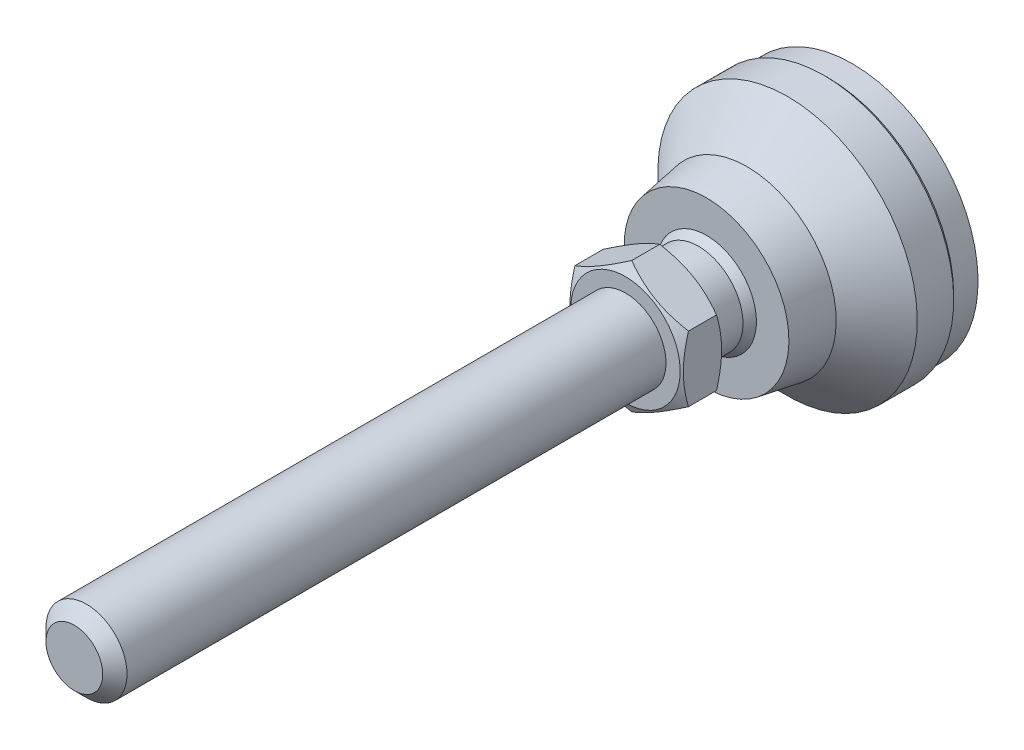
ISO-10303-21;
HEADER;
FILE_DESCRIPTION(('STEP AP214'),'2;1');
FILE_NAME('part.step','',(''),(''),'','','');
FILE_SCHEMA(('AUTOMOTIVE_DESIGN { 1 0 10303 214 1 1 1 1 }'));
ENDSEC;
DATA;
#1=APPLICATION_CONTEXT('core data for automotive mechanical design processes');
#2=APPLICATION_PROTOCOL_DEFINITION('international standard','automotive_design',2000,#1);
#3=PRODUCT_CONTEXT('',#1,'mechanical');
#4=PRODUCT('Part','Part','',(#3));
#5=PRODUCT_RELATED_PRODUCT_CATEGORY('part','',(#4));
#6=PRODUCT_DEFINITION_FORMATION('','',#4);
#7=PRODUCT_DEFINITION_CONTEXT('part definition',#1,'design');
#8=PRODUCT_DEFINITION('design','',#6,#7);
#9=PRODUCT_DEFINITION_SHAPE('','',#8);
#10=(LENGTH_UNIT() NAMED_UNIT(*) SI_UNIT(.MILLI.,.METRE.));
#11=(NAMED_UNIT(*) PLANE_ANGLE_UNIT() SI_UNIT($,.RADIAN.));
#12=(NAMED_UNIT(*) SI_UNIT($,.STERADIAN.) SOLID_ANGLE_UNIT());
#13=UNCERTAINTY_MEASURE_WITH_UNIT(LENGTH_MEASURE(1.E-05),#10,'distance_accuracy_value','');
#14=(GEOMETRIC_REPRESENTATION_CONTEXT(3) GLOBAL_UNCERTAINTY_ASSIGNED_CONTEXT((#13)) GLOBAL_UNIT_ASSIGNED_CONTEXT((#10,
#11,#12)) REPRESENTATION_CONTEXT('',''));
#15=CARTESIAN_POINT('',(0.,0.,0.));
#16=DIRECTION('',(0.,0.,1.));
#17=DIRECTION('',(1.,0.,0.));
#18=AXIS2_PLACEMENT_3D('',#15,#16,#17);
#19=CARTESIAN_POINT('',(0.,0.,3.));
#20=DIRECTION('',(0.,0.,-1.));
#21=DIRECTION('',(0.,1.,0.));
#22=AXIS2_PLACEMENT_3D('',#19,#20,#21);
#23=CYLINDRICAL_SURFACE('',#22,5.49999999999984);
#24=CARTESIAN_POINT('',(0.,0.,23.));
#25=DIRECTION('',(0.,0.,-1.));
#26=DIRECTION('',(0.,1.,0.));
#27=AXIS2_PLACEMENT_3D('',#24,#25,#26);
#28=CIRCLE('',#27,5.49999999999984);
#29=CARTESIAN_POINT('',(0.,5.49999999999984,23.));
#30=VERTEX_POINT('',#29);
#31=EDGE_CURVE('E112',#30,#30,#28,.T.);
#32=ORIENTED_EDGE('',*,*,#31,.T.);
#33=EDGE_LOOP('',(#32));
#34=FACE_BOUND('',#33,.T.);
#35=CARTESIAN_POINT('',(0.,0.,19.0000000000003));
#36=DIRECTION('',(0.,0.,1.));
#37=DIRECTION('',(0.,-1.,0.));
#38=AXIS2_PLACEMENT_3D('',#35,#36,#37);
#39=CIRCLE('',#38,5.49999999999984);
#40=CARTESIAN_POINT('',(-5.49999999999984,0.,19.0000000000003));
#41=VERTEX_POINT('',#40);
#42=EDGE_CURVE('E115',#41,#41,#39,.T.);
#43=ORIENTED_EDGE('',*,*,#42,.T.);
#44=EDGE_LOOP('',(#43));
#45=FACE_BOUND('',#44,.T.);
#46=ADVANCED_FACE('F14',(#34,#45),#23,.T.);
#47=CARTESIAN_POINT('',(0.,0.,14.6698729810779));
#48=DIRECTION('',(0.,0.,1.));
#49=DIRECTION('',(-1.,0.,0.));
#50=AXIS2_PLACEMENT_3D('',#47,#48,#49);
#51=SPHERICAL_SURFACE('',#50,7.);
#52=CARTESIAN_POINT('',(0.,0.,18.));
#53=DIRECTION('',(0.,0.,1.));
#54=DIRECTION('',(0.,-1.,0.));
#55=AXIS2_PLACEMENT_3D('',#52,#53,#54);
#56=CIRCLE('',#55,6.15713034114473);
#57=CARTESIAN_POINT('',(-6.15713034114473,0.,18.));
#58=VERTEX_POINT('',#57);
#59=EDGE_CURVE('E284',#58,#58,#56,.T.);
#60=CARTESIAN_POINT('',(-5.49999999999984,0.,19.0000000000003));
#61=CARTESIAN_POINT('',(-5.50771979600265,0.,18.9901945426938));
#62=CARTESIAN_POINT('',(-5.51541336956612,0.,18.9803684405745));
#63=CARTESIAN_POINT('',(-5.53074785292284,0.,18.9606752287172));
#64=CARTESIAN_POINT('',(-5.53838876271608,0.,18.9508081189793));
#65=CARTESIAN_POINT('',(-5.55361769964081,0.,18.9310331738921));
#66=CARTESIAN_POINT('',(-5.56120572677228,0.,18.9211253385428));
#67=CARTESIAN_POINT('',(-5.57632868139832,0.,18.9012692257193));
#68=CARTESIAN_POINT('',(-5.58386360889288,0.,18.8913209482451));
#69=CARTESIAN_POINT('',(-5.59888014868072,0.,18.871384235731));
#70=CARTESIAN_POINT('',(-5.60636176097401,0.,18.8613958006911));
#71=CARTESIAN_POINT('',(-5.62127145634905,0.,18.841379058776));
#72=CARTESIAN_POINT('',(-5.62869953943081,0.,18.8313507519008));
#73=CARTESIAN_POINT('',(-5.64350196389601,0.,18.81125455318));
#74=CARTESIAN_POINT('',(-5.65087630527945,0.,18.8011866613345));
#75=CARTESIAN_POINT('',(-5.66557103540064,0.,18.781011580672));
#76=CARTESIAN_POINT('',(-5.67289142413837,0.,18.770904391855));
#77=CARTESIAN_POINT('',(-5.68747803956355,0.,18.7506510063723));
#78=CARTESIAN_POINT('',(-5.69474426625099,0.,18.7405048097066));
#79=CARTESIAN_POINT('',(-5.70922234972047,0.,18.7201736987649));
#80=CARTESIAN_POINT('',(-5.7164342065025,0.,18.7099887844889));
#81=CARTESIAN_POINT('',(-5.7308033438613,0.,18.6895805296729));
#82=CARTESIAN_POINT('',(-5.73796062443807,0.,18.6793571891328));
#83=CARTESIAN_POINT('',(-5.75222040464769,0.,18.6588723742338));
#84=CARTESIAN_POINT('',(-5.75932290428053,0.,18.6486108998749));
#85=CARTESIAN_POINT('',(-5.77347291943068,0.,18.6280501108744));
#86=CARTESIAN_POINT('',(-5.78052043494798,0.,18.6177507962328));
#87=CARTESIAN_POINT('',(-5.79456028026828,0.,18.5971146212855));
#88=CARTESIAN_POINT('',(-5.80155261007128,0.,18.5867777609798));
#89=CARTESIAN_POINT('',(-5.81548188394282,0.,18.5660667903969));
#90=CARTESIAN_POINT('',(-5.82241882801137,0.,18.5556926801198));
#91=CARTESIAN_POINT('',(-5.83623713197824,0.,18.5349075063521));
#92=CARTESIAN_POINT('',(-5.84311849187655,0.,18.5244964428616));
#93=CARTESIAN_POINT('',(-5.85682543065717,0.,18.5036376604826));
#94=CARTESIAN_POINT('',(-5.86365100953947,0.,18.493189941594));
#95=CARTESIAN_POINT('',(-5.87724619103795,0.,18.4722581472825));
#96=CARTESIAN_POINT('',(-5.88401579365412,0.,18.4617740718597));
#97=CARTESIAN_POINT('',(-5.89749882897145,0.,18.4407698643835));
#98=CARTESIAN_POINT('',(-5.90421226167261,0.,18.4302497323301));
#99=CARTESIAN_POINT('',(-5.91758276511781,0.,18.4091737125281));
#100=CARTESIAN_POINT('',(-5.92423983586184,0.,18.3986178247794));
#101=CARTESIAN_POINT('',(-5.93749742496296,0.,18.3774705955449));
#102=CARTESIAN_POINT('',(-5.94409794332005,0.,18.366879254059));
#103=CARTESIAN_POINT('',(-5.95724223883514,0.,18.3456614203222));
#104=CARTESIAN_POINT('',(-5.96378601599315,0.,18.3350349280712));
#105=CARTESIAN_POINT('',(-5.9768166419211,0.,18.313747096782));
#106=CARTESIAN_POINT('',(-5.98330349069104,0.,18.3030857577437));
#107=CARTESIAN_POINT('',(-5.99622007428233,0.,18.2817285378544));
#108=CARTESIAN_POINT('',(-6.00264980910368,0.,18.2710326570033));
#109=CARTESIAN_POINT('',(-6.015451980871,0.,18.249606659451));
#110=CARTESIAN_POINT('',(-6.02182441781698,0.,18.2388765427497));
#111=CARTESIAN_POINT('',(-6.034511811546,0.,18.217382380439));
#112=CARTESIAN_POINT('',(-6.04082676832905,0.,18.2066183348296));
#113=CARTESIAN_POINT('',(-6.05339902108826,0.,18.1850566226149));
#114=CARTESIAN_POINT('',(-6.05965631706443,0.,18.1742589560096));
#115=CARTESIAN_POINT('',(-6.07211306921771,0.,18.1526303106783));
#116=CARTESIAN_POINT('',(-6.07831252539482,0.,18.1417993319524));
#117=CARTESIAN_POINT('',(-6.09065342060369,0.,18.1201043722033));
#118=CARTESIAN_POINT('',(-6.09679485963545,0.,18.1092403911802));
#119=CARTESIAN_POINT('',(-6.10901954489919,0.,18.0874797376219));
#120=CARTESIAN_POINT('',(-6.11510279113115,0.,18.0765830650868));
#121=CARTESIAN_POINT('',(-6.12721091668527,0.,18.054757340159));
#122=CARTESIAN_POINT('',(-6.13323579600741,0.,18.0438282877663));
#123=CARTESIAN_POINT('',(-6.14522701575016,0.,18.0219381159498));
#124=CARTESIAN_POINT('',(-6.15119335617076,0.,18.010976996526));
#125=CARTESIAN_POINT('',(-6.15713034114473,0.,18.));
#126=B_SPLINE_CURVE_WITH_KNOTS('',3,(#60,#61,#62,#63,#64,#65,#66,#67,#68,#69,#70,#71,#72,#73,
#74,#75,#76,#77,#78,#79,#80,#81,#82,#83,#84,#85,#86,#87,#88,#89,#90,#91,#92,#93,#94,#95,#96,#97,
#98,#99,#100,#101,#102,#103,#104,#105,#106,#107,#108,#109,#110,#111,#112,#113,#114,#115,#116,
#117,#118,#119,#120,#121,#122,#123,#124,#125),.UNSPECIFIED.,.F.,.F.,(4,2,2,2,2,2,2,2,2,2,2,2,2,
2,2,2,2,2,2,2,2,2,2,2,2,2,2,2,2,2,2,2,4),(0.,0.0374389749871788,0.0748779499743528,
0.112316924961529,0.149755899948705,0.187194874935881,0.224633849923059,0.262072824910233,
0.29951179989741,0.336950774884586,0.374389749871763,0.411828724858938,0.449267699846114,
0.486706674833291,0.524145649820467,0.561584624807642,0.599023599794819,0.636462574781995,
0.673901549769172,0.711340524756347,0.748779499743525,0.786218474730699,0.823657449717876,
0.86109642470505,0.898535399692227,0.935974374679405,0.973413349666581,1.01085232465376,
1.04829129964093,1.08573027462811,1.12316924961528,1.16060822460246,1.19804719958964),.UNSPECIFIED.);
#127=EDGE_CURVE('BSEAM243',#41,#58,#126,.T.);
#128=ORIENTED_EDGE('',*,*,#42,.F.);
#129=ORIENTED_EDGE('',*,*,#59,.T.);
#130=ORIENTED_EDGE('',*,*,#127,.T.);
#131=ORIENTED_EDGE('',*,*,#127,.F.);
#132=EDGE_LOOP('',(#128,#130,#129,#131));
#133=FACE_BOUND('',#132,.T.);
#134=ADVANCED_FACE('F243',(#133),#51,.T.);
#135=CARTESIAN_POINT('',(0.,0.,3.50000000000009));
#136=DIRECTION('',(0.,0.,1.));
#137=DIRECTION('',(0.,-1.,0.));
#138=AXIS2_PLACEMENT_3D('',#135,#136,#137);
#139=CONICAL_SURFACE('',#138,16.,0.785398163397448);
#140=CARTESIAN_POINT('',(0.,0.,3.00000000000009));
#141=DIRECTION('',(0.,0.,-1.));
#142=DIRECTION('',(0.,1.,0.));
#143=AXIS2_PLACEMENT_3D('',#140,#141,#142);
#144=CIRCLE('',#143,15.5);
#145=CARTESIAN_POINT('',(0.,15.5,3.00000000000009));
#146=VERTEX_POINT('',#145);
#147=EDGE_CURVE('E85',#146,#146,#144,.T.);
#148=ORIENTED_EDGE('',*,*,#147,.F.);
#149=EDGE_LOOP('',(#148));
#150=FACE_BOUND('',#149,.T.);
#151=CARTESIAN_POINT('',(0.,0.,3.50000000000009));
#152=DIRECTION('',(0.,0.,-1.));
#153=DIRECTION('',(0.,1.,0.));
#154=AXIS2_PLACEMENT_3D('',#151,#152,#153);
#155=CIRCLE('',#154,16.);
#156=CARTESIAN_POINT('',(0.,16.,3.50000000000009));
#157=VERTEX_POINT('',#156);
#158=EDGE_CURVE('E88',#157,#157,#155,.T.);
#159=ORIENTED_EDGE('',*,*,#158,.T.);
#160=EDGE_LOOP('',(#159));
#161=FACE_BOUND('',#160,.T.);
#162=ADVANCED_FACE('F246',(#150,#161),#139,.T.);
#163=CARTESIAN_POINT('',(0.,0.,3.));
#164=DIRECTION('',(0.,0.,-1.));
#165=DIRECTION('',(0.,1.,0.));
#166=AXIS2_PLACEMENT_3D('',#163,#164,#165);
#167=CYLINDRICAL_SURFACE('',#166,16.);
#168=ORIENTED_EDGE('',*,*,#158,.F.);
#169=EDGE_LOOP('',(#168));
#170=FACE_BOUND('',#169,.T.);
#171=CARTESIAN_POINT('',(0.,0.,8.00000000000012));
#172=DIRECTION('',(0.,0.,-1.));
#173=DIRECTION('',(0.,1.,0.));
#174=AXIS2_PLACEMENT_3D('',#171,#172,#173);
#175=CIRCLE('',#174,16.);
#176=CARTESIAN_POINT('',(0.,16.,8.00000000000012));
#177=VERTEX_POINT('',#176);
#178=EDGE_CURVE('E105',#177,#177,#175,.T.);
#179=ORIENTED_EDGE('',*,*,#178,.T.);
#180=EDGE_LOOP('',(#179));
#181=FACE_BOUND('',#180,.T.);
#182=ADVANCED_FACE('F391',(#170,#181),#167,.T.);
#183=CARTESIAN_POINT('',(0.,0.,13.));
#184=DIRECTION('',(0.,0.,-1.));
#185=DIRECTION('',(0.,1.,0.));
#186=AXIS2_PLACEMENT_3D('',#183,#184,#185);
#187=CONICAL_SURFACE('',#186,11.,0.785398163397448);
#188=ORIENTED_EDGE('',*,*,#178,.F.);
#189=EDGE_LOOP('',(#188));
#190=FACE_BOUND('',#189,.T.);
#191=CARTESIAN_POINT('',(0.,0.,13.));
#192=DIRECTION('',(0.,0.,-1.));
#193=DIRECTION('',(0.,1.,0.));
#194=AXIS2_PLACEMENT_3D('',#191,#192,#193);
#195=CIRCLE('',#194,11.);
#196=CARTESIAN_POINT('',(0.,11.,13.));
#197=VERTEX_POINT('',#196);
#198=EDGE_CURVE('E108',#197,#197,#195,.T.);
#199=ORIENTED_EDGE('',*,*,#198,.T.);
#200=EDGE_LOOP('',(#199));
#201=FACE_BOUND('',#200,.T.);
#202=ADVANCED_FACE('F398',(#190,#201),#187,.T.);
#203=CARTESIAN_POINT('',(0.,0.,19.));
#204=DIRECTION('',(0.,0.,-1.));
#205=DIRECTION('',(0.,1.,0.));
#206=AXIS2_PLACEMENT_3D('',#203,#204,#205);
#207=CONICAL_SURFACE('',#206,10.,0.165148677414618);
#208=ORIENTED_EDGE('',*,*,#198,.F.);
#209=EDGE_LOOP('',(#208));
#210=FACE_BOUND('',#209,.T.);
#211=CARTESIAN_POINT('',(0.,0.,18.));
#212=DIRECTION('',(0.,0.,-1.));
#213=DIRECTION('',(0.,1.,0.));
#214=AXIS2_PLACEMENT_3D('',#211,#212,#213);
#215=CIRCLE('',#214,10.1666666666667);
#216=CARTESIAN_POINT('',(0.,10.1666666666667,18.));
#217=VERTEX_POINT('',#216);
#218=EDGE_CURVE('E93',#217,#217,#215,.T.);
#219=ORIENTED_EDGE('',*,*,#218,.T.);
#220=EDGE_LOOP('',(#219));
#221=FACE_BOUND('',#220,.T.);
#222=ADVANCED_FACE('F241',(#210,#221),#207,.T.);
#223=CARTESIAN_POINT('',(-10.1666666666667,0.,18.));
#224=DIRECTION('',(0.,0.,1.));
#225=DIRECTION('',(0.,-1.,0.));
#226=AXIS2_PLACEMENT_3D('',#223,#224,#225);
#227=PLANE('',#226);
#228=ORIENTED_EDGE('',*,*,#218,.F.);
#229=EDGE_LOOP('',(#228));
#230=FACE_BOUND('',#229,.T.);
#231=ORIENTED_EDGE('',*,*,#59,.F.);
#232=EDGE_LOOP('',(#231));
#233=FACE_BOUND('',#232,.T.);
#234=ADVANCED_FACE('F236',(#230,#233),#227,.T.);
#235=CARTESIAN_POINT('',(0.,-8.08290376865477,23.));
#236=DIRECTION('',(0.,0.,-1.));
#237=DIRECTION('',(0.,1.,0.));
#238=AXIS2_PLACEMENT_3D('',#235,#236,#237);
#239=PLANE('',#238);
#240=CARTESIAN_POINT('',(0.,0.,23.));
#241=DIRECTION('',(0.,0.,1.));
#242=DIRECTION('',(0.,-1.,0.));
#243=AXIS2_PLACEMENT_3D('',#240,#241,#242);
#244=CIRCLE('',#243,6.75);
#245=CARTESIAN_POINT('',(0.,-6.75,23.));
#246=VERTEX_POINT('',#245);
#247=EDGE_CURVE('E80',#246,#246,#244,.T.);
#248=ORIENTED_EDGE('',*,*,#247,.F.);
#249=EDGE_LOOP('',(#248));
#250=FACE_BOUND('',#249,.T.);
#251=ORIENTED_EDGE('',*,*,#31,.F.);
#252=EDGE_LOOP('',(#251));
#253=FACE_BOUND('',#252,.T.);
#254=ADVANCED_FACE('F240',(#250,#253),#239,.T.);
#255=CARTESIAN_POINT('',(0.,0.,0.));
#256=DIRECTION('',(0.,0.,1.));
#257=DIRECTION('',(0.,-1.,0.));
#258=AXIS2_PLACEMENT_3D('',#255,#256,#257);
#259=CYLINDRICAL_SURFACE('',#258,15.5);
#260=CARTESIAN_POINT('',(0.,0.,0.));
#261=DIRECTION('',(0.,0.,-1.));
#262=DIRECTION('',(0.,1.,0.));
#263=AXIS2_PLACEMENT_3D('',#260,#261,#262);
#264=CIRCLE('',#263,15.5);
#265=CARTESIAN_POINT('',(0.,15.5,0.));
#266=VERTEX_POINT('',#265);
#267=EDGE_CURVE('E292',#266,#266,#264,.T.);
#268=ORIENTED_EDGE('',*,*,#267,.F.);
#269=EDGE_LOOP('',(#268));
#270=FACE_BOUND('',#269,.T.);
#271=ORIENTED_EDGE('',*,*,#147,.T.);
#272=EDGE_LOOP('',(#271));
#273=FACE_BOUND('',#272,.T.);
#274=ADVANCED_FACE('F250',(#270,#273),#259,.T.);
#275=CARTESIAN_POINT('',(0.,0.,0.));
#276=DIRECTION('',(0.,0.,-1.));
#277=DIRECTION('',(0.,1.,0.));
#278=AXIS2_PLACEMENT_3D('',#275,#276,#277);
#279=PLANE('',#278);
#280=ORIENTED_EDGE('',*,*,#267,.T.);
#281=EDGE_LOOP('',(#280));
#282=FACE_BOUND('',#281,.T.);
#283=ADVANCED_FACE('F133',(#282),#279,.T.);
#284=CARTESIAN_POINT('',(0.,0.,23.));
#285=DIRECTION('',(0.,0.,1.));
#286=DIRECTION('',(0.,-1.,0.));
#287=AXIS2_PLACEMENT_3D('',#284,#285,#286);
#288=CONICAL_SURFACE('',#287,6.75,1.0471975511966);
#289=CARTESIAN_POINT('',(7.0002,-4.04133641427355,23.7696190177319));
#290=CARTESIAN_POINT('',(6.84633209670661,-4.13017208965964,23.7183374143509));
#291=CARTESIAN_POINT('',(6.69189049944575,-4.21933898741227,23.669383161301));
#292=CARTESIAN_POINT('',(6.38175307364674,-4.3983969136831,23.5767703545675));
#293=CARTESIAN_POINT('',(6.22605673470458,-4.4882882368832,23.5331140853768));
#294=CARTESIAN_POINT('',(5.75647483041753,-4.7594014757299,23.4109491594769));
#295=CARTESIAN_POINT('',(5.4407356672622,-4.94169356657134,23.3414631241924));
#296=CARTESIAN_POINT('',(4.96823775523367,-5.21449036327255,23.2599825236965));
#297=CARTESIAN_POINT('',(4.81289077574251,-5.30417998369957,23.2367710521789));
#298=CARTESIAN_POINT('',(4.50149488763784,-5.48396448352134,23.1978487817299));
#299=CARTESIAN_POINT('',(4.34544604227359,-5.57405932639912,23.1821373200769));
#300=CARTESIAN_POINT('',(4.03307732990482,-5.75440548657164,23.1586154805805));
#301=CARTESIAN_POINT('',(3.87675797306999,-5.84465650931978,23.1507961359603));
#302=CARTESIAN_POINT('',(3.56398349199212,-6.02523694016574,23.1432178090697));
#303=CARTESIAN_POINT('',(3.40752837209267,-6.11556634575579,23.1434585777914));
#304=CARTESIAN_POINT('',(2.97889312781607,-6.36303901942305,23.155197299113));
#305=CARTESIAN_POINT('',(2.7068533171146,-6.52010127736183,23.1749033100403));
#306=CARTESIAN_POINT('',(2.1645805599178,-6.83318259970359,23.2373910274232));
#307=CARTESIAN_POINT('',(1.89434952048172,-6.98920056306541,23.2801940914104));
#308=CARTESIAN_POINT('',(1.35098545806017,-7.30291195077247,23.3871892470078));
#309=CARTESIAN_POINT('',(1.07792099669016,-7.46056579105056,23.4518346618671));
#310=CARTESIAN_POINT('',(0.535864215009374,-7.77352241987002,23.5985536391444));
#311=CARTESIAN_POINT('',(0.266864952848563,-7.92882921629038,23.680592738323));
#312=CARTESIAN_POINT('',(-0.000199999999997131,-8.08301923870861,23.7696190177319));
#313=B_SPLINE_CURVE_WITH_KNOTS('',3,(#289,#290,#291,#292,#293,#294,#295,#296,#297,#298,#299,
#300,#301,#302,#303,#304,#305,#306,#307,#308,#309,#310,#311,#312),.UNSPECIFIED.,.F.,.F.,(4,2,2,
2,2,2,2,2,2,2,2,4),(0.,0.554727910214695,1.10969417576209,2.2219327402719,2.76443041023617,
3.30688013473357,3.8487128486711,4.39052882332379,5.33376515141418,6.27787517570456,
7.24292418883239,8.20607866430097),.UNSPECIFIED.);
#314=CARTESIAN_POINT('',(7.,-4.04145188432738,23.7695523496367));
#315=VERTEX_POINT('',#314);
#316=CARTESIAN_POINT('',(0.,-8.08290376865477,23.7695523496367));
#317=VERTEX_POINT('',#316);
#318=EDGE_CURVE('E33',#315,#317,#313,.T.);
#319=ORIENTED_EDGE('',*,*,#318,.T.);
#320=CARTESIAN_POINT('',(0.000200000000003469,-8.0830192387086,23.7696190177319));
#321=CARTESIAN_POINT('',(-0.153667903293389,-7.99418356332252,23.7183374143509));
#322=CARTESIAN_POINT('',(-0.308109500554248,-7.90501666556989,23.669383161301));
#323=CARTESIAN_POINT('',(-0.618246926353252,-7.72595873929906,23.5767703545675));
#324=CARTESIAN_POINT('',(-0.773943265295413,-7.63606741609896,23.5331140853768));
#325=CARTESIAN_POINT('',(-1.24352516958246,-7.36495417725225,23.4109491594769));
#326=CARTESIAN_POINT('',(-1.5592643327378,-7.18266208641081,23.3414631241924));
#327=CARTESIAN_POINT('',(-2.03176224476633,-6.90986528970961,23.2599825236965));
#328=CARTESIAN_POINT('',(-2.18710922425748,-6.82017566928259,23.2367710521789));
#329=CARTESIAN_POINT('',(-2.49850511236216,-6.64039116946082,23.1978487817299));
#330=CARTESIAN_POINT('',(-2.65455395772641,-6.55029632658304,23.1821373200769));
#331=CARTESIAN_POINT('',(-2.96692267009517,-6.36995016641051,23.1586154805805));
#332=CARTESIAN_POINT('',(-3.12324202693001,-6.27969914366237,23.1507961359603));
#333=CARTESIAN_POINT('',(-3.43601650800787,-6.09911871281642,23.1432178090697));
#334=CARTESIAN_POINT('',(-3.59247162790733,-6.00878930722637,23.1434585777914));
#335=CARTESIAN_POINT('',(-4.02110687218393,-5.76131663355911,23.155197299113));
#336=CARTESIAN_POINT('',(-4.29314668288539,-5.60425437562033,23.1749033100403));
#337=CARTESIAN_POINT('',(-4.83541944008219,-5.29117305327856,23.2373910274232));
#338=CARTESIAN_POINT('',(-5.10565047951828,-5.13515508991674,23.2801940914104));
#339=CARTESIAN_POINT('',(-5.64901454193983,-4.82144370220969,23.3871892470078));
#340=CARTESIAN_POINT('',(-5.92207900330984,-4.6637898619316,23.4518346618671));
#341=CARTESIAN_POINT('',(-6.46413578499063,-4.35083323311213,23.5985536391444));
#342=CARTESIAN_POINT('',(-6.73313504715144,-4.19552643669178,23.680592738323));
#343=CARTESIAN_POINT('',(-7.0002,-4.04133641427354,23.7696190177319));
#344=B_SPLINE_CURVE_WITH_KNOTS('',3,(#320,#321,#322,#323,#324,#325,#326,#327,#328,#329,#330,
#331,#332,#333,#334,#335,#336,#337,#338,#339,#340,#341,#342,#343),.UNSPECIFIED.,.F.,.F.,(4,2,2,
2,2,2,2,2,2,2,2,4),(0.,0.554727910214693,1.10969417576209,2.2219327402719,2.76443041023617,
3.30688013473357,3.84871284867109,4.39052882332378,5.33376515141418,6.27787517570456,
7.2429241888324,8.20607866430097),.UNSPECIFIED.);
#345=CARTESIAN_POINT('',(-7.,-4.04145188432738,23.7695523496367));
#346=VERTEX_POINT('',#345);
#347=EDGE_CURVE('E9',#317,#346,#344,.T.);
#348=ORIENTED_EDGE('',*,*,#347,.T.);
#349=CARTESIAN_POINT('',(-7.,10.850002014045,26.5576949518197));
#350=CARTESIAN_POINT('',(-7.,10.5443141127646,26.4094323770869));
#351=CARTESIAN_POINT('',(-7.,10.2379238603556,26.2625930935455));
#352=CARTESIAN_POINT('',(-7.,9.62336510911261,25.9725617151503));
#353=CARTESIAN_POINT('',(-7.,9.31519633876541,25.8293701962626));
#354=CARTESIAN_POINT('',(-7.,8.69511645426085,25.5467133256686));
#355=CARTESIAN_POINT('',(-7.,8.3831940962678,25.407272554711));
#356=CARTESIAN_POINT('',(-7.,7.75686646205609,25.1341051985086));
#357=CARTESIAN_POINT('',(-7.,7.44246130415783,25.0003783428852));
#358=CARTESIAN_POINT('',(-7.,6.8005432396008,24.7359773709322));
#359=CARTESIAN_POINT('',(-7.,6.47293302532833,24.6055381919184));
#360=CARTESIAN_POINT('',(-7.,5.81387842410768,24.3545460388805));
#361=CARTESIAN_POINT('',(-7.,5.48243361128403,24.2339941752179));
#362=CARTESIAN_POINT('',(-7.,4.81580073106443,24.0059459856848));
#363=CARTESIAN_POINT('',(-7.,4.48062182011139,23.8984231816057));
#364=CARTESIAN_POINT('',(-7.,3.8054680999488,23.6998857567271));
#365=CARTESIAN_POINT('',(-7.,3.46549483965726,23.6088659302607));
#366=CARTESIAN_POINT('',(-7.,2.7823881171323,23.4481960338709));
#367=CARTESIAN_POINT('',(-7.,2.43928260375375,23.3784303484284));
#368=CARTESIAN_POINT('',(-7.,1.92150455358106,23.2927457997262));
#369=CARTESIAN_POINT('',(-7.,1.74837915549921,23.2673437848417));
#370=CARTESIAN_POINT('',(-7.,1.40126981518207,23.2233594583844));
#371=CARTESIAN_POINT('',(-7.,1.22728595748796,23.2047764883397));
#372=CARTESIAN_POINT('',(-7.,0.880963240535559,23.1750332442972));
#373=CARTESIAN_POINT('',(-7.,0.708632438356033,23.1637795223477));
#374=CARTESIAN_POINT('',(-7.,0.363649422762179,23.1485691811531));
#375=CARTESIAN_POINT('',(-7.,0.190997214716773,23.1446124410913));
#376=CARTESIAN_POINT('',(-7.,-0.154320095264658,23.1440904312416));
#377=CARTESIAN_POINT('',(-7.,-0.326985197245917,23.1475251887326));
#378=CARTESIAN_POINT('',(-7.,-0.672017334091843,23.1617023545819));
#379=CARTESIAN_POINT('',(-7.,-0.84438435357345,23.1724451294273));
#380=CARTESIAN_POINT('',(-7.,-1.25880867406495,23.206832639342));
#381=CARTESIAN_POINT('',(-7.,-1.50058352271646,23.2339544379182));
#382=CARTESIAN_POINT('',(-7.,-1.98232359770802,23.3010954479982));
#383=CARTESIAN_POINT('',(-7.,-2.22228857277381,23.3411164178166));
#384=CARTESIAN_POINT('',(-7.,-2.93920273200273,23.4784046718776));
#385=CARTESIAN_POINT('',(-7.,-3.41290087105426,23.5928719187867));
#386=CARTESIAN_POINT('',(-7.,-4.12120129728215,23.79118189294));
#387=CARTESIAN_POINT('',(-7.,-4.35948213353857,23.8626400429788));
#388=CARTESIAN_POINT('',(-7.,-4.83372911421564,24.0129319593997));
#389=CARTESIAN_POINT('',(-7.,-5.06969524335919,24.0917657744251));
#390=CARTESIAN_POINT('',(-7.,-5.53938795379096,24.2555479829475));
#391=CARTESIAN_POINT('',(-7.,-5.77311525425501,24.3404943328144));
#392=CARTESIAN_POINT('',(-7.,-6.2386364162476,24.5155067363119));
#393=CARTESIAN_POINT('',(-7.,-6.47043030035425,24.6055727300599));
#394=CARTESIAN_POINT('',(-7.,-7.0172043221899,24.8238713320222));
#395=CARTESIAN_POINT('',(-7.,-7.33144078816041,24.953963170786));
#396=CARTESIAN_POINT('',(-7.,-7.95724517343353,25.220432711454));
#397=CARTESIAN_POINT('',(-7.,-8.26881292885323,25.3568107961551));
#398=CARTESIAN_POINT('',(-7.,-8.88977072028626,25.6345904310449));
#399=CARTESIAN_POINT('',(-7.,-9.19916030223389,25.7759929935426));
#400=CARTESIAN_POINT('',(-7.,-9.81607470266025,26.0628162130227));
#401=CARTESIAN_POINT('',(-7.,-10.1235994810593,26.2082369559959));
#402=CARTESIAN_POINT('',(-7.,-10.737411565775,26.5024965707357));
#403=CARTESIAN_POINT('',(-7.,-11.0436971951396,26.6513389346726));
#404=CARTESIAN_POINT('',(-7.,-11.6549491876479,26.9517108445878));
#405=CARTESIAN_POINT('',(-7.,-11.959915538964,27.1032404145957));
#406=CARTESIAN_POINT('',(-7.,-12.8730696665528,27.5611046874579));
#407=CARTESIAN_POINT('',(-7.,-13.4795948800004,27.8707547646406));
#408=CARTESIAN_POINT('',(-7.,-14.6386710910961,28.4700315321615));
#409=CARTESIAN_POINT('',(-7.,-15.1914814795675,28.7591587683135));
#410=CARTESIAN_POINT('',(-7.,-16.2950493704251,29.3413491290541));
#411=CARTESIAN_POINT('',(-7.,-16.8458067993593,29.634412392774));
#412=CARTESIAN_POINT('',(-7.,-17.9443487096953,30.2228017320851));
#413=CARTESIAN_POINT('',(-7.,-18.4921371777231,30.5181203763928));
#414=CARTESIAN_POINT('',(-7.,-19.5864015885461,31.1111087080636));
#415=CARTESIAN_POINT('',(-7.,-20.1328776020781,31.4087782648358));
#416=CARTESIAN_POINT('',(-7.,-20.6788706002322,31.7073252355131));
#417=B_SPLINE_CURVE_WITH_KNOTS('',3,(#349,#350,#351,#352,#353,#354,#355,#356,#357,#358,#359,
#360,#361,#362,#363,#364,#365,#366,#367,#368,#369,#370,#371,#372,#373,#374,#375,#376,#377,#378,
#379,#380,#381,#382,#383,#384,#385,#386,#387,#388,#389,#390,#391,#392,#393,#394,#395,#396,#397,
#398,#399,#400,#401,#402,#403,#404,#405,#406,#407,#408,#409,#410,#411,#412,#413,#414,#415,#416),
.UNSPECIFIED.,.F.,.F.,(4,2,2,2,2,2,2,2,2,2,2,2,2,2,2,2,2,2,2,2,2,2,2,2,2,2,2,2,2,2,2,2,2,4),(0.,
1.01924843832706,2.03865682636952,3.0636248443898,4.08854430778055,5.14628884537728,
6.20415200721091,7.2598279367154,8.31517028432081,9.36466496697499,9.88948893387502,
10.4142622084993,10.9322063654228,11.4501419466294,11.968079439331,12.486042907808,
13.2155045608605,13.9450656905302,15.4049987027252,16.1512319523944,16.8974701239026,
17.6434599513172,18.3894410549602,19.4096506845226,20.4299225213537,21.4504010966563,
22.4709015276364,23.4924943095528,24.5140962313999,26.5570256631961,28.4285709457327,
30.300182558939,32.1671439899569,34.034002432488),.UNSPECIFIED.);
#418=CARTESIAN_POINT('',(-7.,4.04145188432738,23.7695523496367));
#419=VERTEX_POINT('',#418);
#420=EDGE_CURVE('E72',#346,#419,#417,.F.);
#421=ORIENTED_EDGE('',*,*,#420,.T.);
#422=CARTESIAN_POINT('',(-7.0002,4.04133641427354,23.7696190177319));
#423=CARTESIAN_POINT('',(-6.84633209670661,4.13017208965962,23.7183374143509));
#424=CARTESIAN_POINT('',(-6.69189049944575,4.21933898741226,23.669383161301));
#425=CARTESIAN_POINT('',(-6.38175307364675,4.39839691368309,23.5767703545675));
#426=CARTESIAN_POINT('',(-6.22605673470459,4.48828823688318,23.5331140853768));
#427=CARTESIAN_POINT('',(-5.75647483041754,4.75940147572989,23.4109491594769));
#428=CARTESIAN_POINT('',(-5.4407356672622,4.94169356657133,23.3414631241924));
#429=CARTESIAN_POINT('',(-4.96823775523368,5.21449036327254,23.2599825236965));
#430=CARTESIAN_POINT('',(-4.81289077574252,5.30417998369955,23.2367710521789));
#431=CARTESIAN_POINT('',(-4.50149488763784,5.48396448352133,23.1978487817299));
#432=CARTESIAN_POINT('',(-4.3454460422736,5.57405932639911,23.1821373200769));
#433=CARTESIAN_POINT('',(-4.03307732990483,5.75440548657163,23.1586154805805));
#434=CARTESIAN_POINT('',(-3.87675797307,5.84465650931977,23.1507961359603));
#435=CARTESIAN_POINT('',(-3.56398349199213,6.02523694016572,23.1432178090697));
#436=CARTESIAN_POINT('',(-3.40752837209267,6.11556634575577,23.1434585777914));
#437=CARTESIAN_POINT('',(-2.97889312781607,6.36303901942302,23.155197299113));
#438=CARTESIAN_POINT('',(-2.70685331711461,6.52010127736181,23.1749033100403));
#439=CARTESIAN_POINT('',(-2.16458055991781,6.83318259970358,23.2373910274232));
#440=CARTESIAN_POINT('',(-1.89434952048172,6.9892005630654,23.2801940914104));
#441=CARTESIAN_POINT('',(-1.35098545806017,7.30291195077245,23.3871892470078));
#442=CARTESIAN_POINT('',(-1.07792099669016,7.46056579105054,23.4518346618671));
#443=CARTESIAN_POINT('',(-0.535864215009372,7.77352241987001,23.5985536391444));
#444=CARTESIAN_POINT('',(-0.266864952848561,7.92882921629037,23.680592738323));
#445=CARTESIAN_POINT('',(0.00019999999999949,8.0830192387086,23.7696190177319));
#446=B_SPLINE_CURVE_WITH_KNOTS('',3,(#422,#423,#424,#425,#426,#427,#428,#429,#430,#431,#432,
#433,#434,#435,#436,#437,#438,#439,#440,#441,#442,#443,#444,#445),.UNSPECIFIED.,.F.,.F.,(4,2,2,
2,2,2,2,2,2,2,2,4),(0.,0.554727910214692,1.10969417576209,2.22193274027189,2.76443041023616,
3.30688013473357,3.84871284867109,4.39052882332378,5.33376515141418,6.27787517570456,
7.2429241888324,8.20607866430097),.UNSPECIFIED.);
#447=CARTESIAN_POINT('',(0.,8.08290376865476,23.7695523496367));
#448=VERTEX_POINT('',#447);
#449=EDGE_CURVE('E79',#419,#448,#446,.T.);
#450=ORIENTED_EDGE('',*,*,#449,.T.);
#451=CARTESIAN_POINT('',(-0.000200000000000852,8.0830192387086,23.7696190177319));
#452=CARTESIAN_POINT('',(0.153667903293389,7.99418356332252,23.7183374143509));
#453=CARTESIAN_POINT('',(0.308109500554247,7.90501666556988,23.669383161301));
#454=CARTESIAN_POINT('',(0.618246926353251,7.72595873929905,23.5767703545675));
#455=CARTESIAN_POINT('',(0.773943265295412,7.63606741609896,23.5331140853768));
#456=CARTESIAN_POINT('',(1.24352516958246,7.36495417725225,23.4109491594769));
#457=CARTESIAN_POINT('',(1.5592643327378,7.18266208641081,23.3414631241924));
#458=CARTESIAN_POINT('',(2.03176224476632,6.9098652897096,23.2599825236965));
#459=CARTESIAN_POINT('',(2.18710922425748,6.82017566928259,23.2367710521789));
#460=CARTESIAN_POINT('',(2.49850511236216,6.64039116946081,23.1978487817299));
#461=CARTESIAN_POINT('',(2.6545539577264,6.55029632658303,23.1821373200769));
#462=CARTESIAN_POINT('',(2.96692267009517,6.36995016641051,23.1586154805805));
#463=CARTESIAN_POINT('',(3.12324202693,6.27969914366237,23.1507961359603));
#464=CARTESIAN_POINT('',(3.43601650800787,6.09911871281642,23.1432178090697));
#465=CARTESIAN_POINT('',(3.59247162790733,6.00878930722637,23.1434585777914));
#466=CARTESIAN_POINT('',(4.02110687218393,5.76131663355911,23.155197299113));
#467=CARTESIAN_POINT('',(4.29314668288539,5.60425437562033,23.1749033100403));
#468=CARTESIAN_POINT('',(4.83541944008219,5.29117305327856,23.2373910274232));
#469=CARTESIAN_POINT('',(5.10565047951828,5.13515508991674,23.2801940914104));
#470=CARTESIAN_POINT('',(5.64901454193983,4.82144370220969,23.3871892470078));
#471=CARTESIAN_POINT('',(5.92207900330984,4.66378986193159,23.4518346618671));
#472=CARTESIAN_POINT('',(6.46413578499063,4.35083323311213,23.5985536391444));
#473=CARTESIAN_POINT('',(6.73313504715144,4.19552643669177,23.680592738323));
#474=CARTESIAN_POINT('',(7.0002,4.04133641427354,23.7696190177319));
#475=B_SPLINE_CURVE_WITH_KNOTS('',3,(#451,#452,#453,#454,#455,#456,#457,#458,#459,#460,#461,
#462,#463,#464,#465,#466,#467,#468,#469,#470,#471,#472,#473,#474),.UNSPECIFIED.,.F.,.F.,(4,2,2,
2,2,2,2,2,2,2,2,4),(0.,0.554727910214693,1.10969417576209,2.2219327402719,2.76443041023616,
3.30688013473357,3.84871284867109,4.39052882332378,5.33376515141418,6.27787517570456,
7.2429241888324,8.20607866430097),.UNSPECIFIED.);
#476=CARTESIAN_POINT('',(7.,4.04145188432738,23.7695523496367));
#477=VERTEX_POINT('',#476);
#478=EDGE_CURVE('E194',#448,#477,#475,.T.);
#479=ORIENTED_EDGE('',*,*,#478,.T.);
#480=CARTESIAN_POINT('',(7.,10.850002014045,26.5576949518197));
#481=CARTESIAN_POINT('',(7.,10.5443141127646,26.4094323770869));
#482=CARTESIAN_POINT('',(7.,10.2379238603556,26.2625930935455));
#483=CARTESIAN_POINT('',(7.,9.62336510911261,25.9725617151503));
#484=CARTESIAN_POINT('',(7.,9.31519633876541,25.8293701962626));
#485=CARTESIAN_POINT('',(7.,8.69511645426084,25.5467133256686));
#486=CARTESIAN_POINT('',(7.,8.38319409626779,25.407272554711));
#487=CARTESIAN_POINT('',(7.,7.75686646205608,25.1341051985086));
#488=CARTESIAN_POINT('',(7.,7.44246130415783,25.0003783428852));
#489=CARTESIAN_POINT('',(7.,6.8005432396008,24.7359773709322));
#490=CARTESIAN_POINT('',(7.,6.47293302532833,24.6055381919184));
#491=CARTESIAN_POINT('',(7.,5.81387842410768,24.3545460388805));
#492=CARTESIAN_POINT('',(7.,5.48243361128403,24.2339941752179));
#493=CARTESIAN_POINT('',(7.,4.81580073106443,24.0059459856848));
#494=CARTESIAN_POINT('',(7.,4.48062182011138,23.8984231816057));
#495=CARTESIAN_POINT('',(7.,3.8054680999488,23.6998857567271));
#496=CARTESIAN_POINT('',(7.,3.46549483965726,23.6088659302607));
#497=CARTESIAN_POINT('',(7.,2.7823881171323,23.4481960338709));
#498=CARTESIAN_POINT('',(7.,2.43928260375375,23.3784303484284));
#499=CARTESIAN_POINT('',(7.,1.92150455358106,23.2927457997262));
#500=CARTESIAN_POINT('',(7.,1.74837915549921,23.2673437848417));
#501=CARTESIAN_POINT('',(7.,1.40126981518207,23.2233594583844));
#502=CARTESIAN_POINT('',(7.,1.22728595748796,23.2047764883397));
#503=CARTESIAN_POINT('',(7.,0.88096324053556,23.1750332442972));
#504=CARTESIAN_POINT('',(7.,0.708632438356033,23.1637795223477));
#505=CARTESIAN_POINT('',(7.,0.36364942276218,23.1485691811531));
#506=CARTESIAN_POINT('',(7.,0.190997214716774,23.1446124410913));
#507=CARTESIAN_POINT('',(7.,-0.154320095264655,23.1440904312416));
#508=CARTESIAN_POINT('',(7.,-0.326985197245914,23.1475251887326));
#509=CARTESIAN_POINT('',(7.,-0.672017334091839,23.1617023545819));
#510=CARTESIAN_POINT('',(7.,-0.844384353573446,23.1724451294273));
#511=CARTESIAN_POINT('',(7.,-1.25880867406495,23.206832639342));
#512=CARTESIAN_POINT('',(7.,-1.50058352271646,23.2339544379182));
#513=CARTESIAN_POINT('',(7.,-1.98232359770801,23.3010954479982));
#514=CARTESIAN_POINT('',(7.,-2.2222885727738,23.3411164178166));
#515=CARTESIAN_POINT('',(7.,-2.93920273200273,23.4784046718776));
#516=CARTESIAN_POINT('',(7.,-3.41290087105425,23.5928719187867));
#517=CARTESIAN_POINT('',(7.,-4.12120129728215,23.79118189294));
#518=CARTESIAN_POINT('',(7.,-4.35948213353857,23.8626400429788));
#519=CARTESIAN_POINT('',(7.,-4.83372911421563,24.0129319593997));
#520=CARTESIAN_POINT('',(7.,-5.06969524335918,24.0917657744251));
#521=CARTESIAN_POINT('',(7.,-5.53938795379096,24.2555479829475));
#522=CARTESIAN_POINT('',(7.,-5.773115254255,24.3404943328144));
#523=CARTESIAN_POINT('',(7.,-6.23863641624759,24.5155067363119));
#524=CARTESIAN_POINT('',(7.,-6.47043030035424,24.6055727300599));
#525=CARTESIAN_POINT('',(7.,-7.01720432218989,24.8238713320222));
#526=CARTESIAN_POINT('',(7.,-7.3314407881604,24.953963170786));
#527=CARTESIAN_POINT('',(7.,-7.95724517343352,25.220432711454));
#528=CARTESIAN_POINT('',(7.,-8.26881292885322,25.3568107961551));
#529=CARTESIAN_POINT('',(7.,-8.88977072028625,25.6345904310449));
#530=CARTESIAN_POINT('',(7.,-9.19916030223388,25.7759929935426));
#531=CARTESIAN_POINT('',(7.,-9.81607470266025,26.0628162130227));
#532=CARTESIAN_POINT('',(7.,-10.1235994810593,26.2082369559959));
#533=CARTESIAN_POINT('',(7.,-10.737411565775,26.5024965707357));
#534=CARTESIAN_POINT('',(7.,-11.0436971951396,26.6513389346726));
#535=CARTESIAN_POINT('',(7.,-11.6549491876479,26.9517108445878));
#536=CARTESIAN_POINT('',(7.,-11.959915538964,27.1032404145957));
#537=CARTESIAN_POINT('',(7.,-12.8730696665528,27.5611046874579));
#538=CARTESIAN_POINT('',(7.,-13.4795948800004,27.8707547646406));
#539=CARTESIAN_POINT('',(7.,-14.6386710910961,28.4700315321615));
#540=CARTESIAN_POINT('',(7.,-15.1914814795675,28.7591587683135));
#541=CARTESIAN_POINT('',(7.,-16.2950493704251,29.3413491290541));
#542=CARTESIAN_POINT('',(7.,-16.8458067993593,29.634412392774));
#543=CARTESIAN_POINT('',(7.,-17.9443487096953,30.2228017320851));
#544=CARTESIAN_POINT('',(7.,-18.4921371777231,30.5181203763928));
#545=CARTESIAN_POINT('',(7.,-19.5864015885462,31.1111087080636));
#546=CARTESIAN_POINT('',(7.,-20.1328776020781,31.4087782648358));
#547=CARTESIAN_POINT('',(7.,-20.6788706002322,31.7073252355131));
#548=B_SPLINE_CURVE_WITH_KNOTS('',3,(#480,#481,#482,#483,#484,#485,#486,#487,#488,#489,#490,
#491,#492,#493,#494,#495,#496,#497,#498,#499,#500,#501,#502,#503,#504,#505,#506,#507,#508,#509,
#510,#511,#512,#513,#514,#515,#516,#517,#518,#519,#520,#521,#522,#523,#524,#525,#526,#527,#528,
#529,#530,#531,#532,#533,#534,#535,#536,#537,#538,#539,#540,#541,#542,#543,#544,#545,#546,#547),
.UNSPECIFIED.,.F.,.F.,(4,2,2,2,2,2,2,2,2,2,2,2,2,2,2,2,2,2,2,2,2,2,2,2,2,2,2,2,2,2,2,2,2,4),(0.,
1.01924843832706,2.03865682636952,3.06362484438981,4.08854430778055,5.14628884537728,
6.20415200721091,7.2598279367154,8.31517028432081,9.36466496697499,9.88948893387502,
10.4142622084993,10.9322063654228,11.4501419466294,11.968079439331,12.4860429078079,
13.2155045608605,13.9450656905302,15.4049987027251,16.1512319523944,16.8974701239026,
17.6434599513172,18.3894410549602,19.4096506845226,20.4299225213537,21.4504010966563,
22.4709015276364,23.4924943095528,24.5140962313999,26.5570256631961,28.4285709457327,
30.300182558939,32.1671439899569,34.0340024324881),.UNSPECIFIED.);
#549=EDGE_CURVE('E187',#477,#315,#548,.T.);
#550=ORIENTED_EDGE('',*,*,#549,.T.);
#551=EDGE_LOOP('',(#319,#348,#421,#450,#479,#550));
#552=FACE_BOUND('',#551,.T.);
#553=ORIENTED_EDGE('',*,*,#247,.T.);
#554=EDGE_LOOP('',(#553));
#555=FACE_BOUND('',#554,.T.);
#556=ADVANCED_FACE('F70',(#552,#555),#288,.T.);
#557=CARTESIAN_POINT('',(0.,0.,96.));
#558=DIRECTION('',(0.,0.,-1.));
#559=DIRECTION('',(0.,1.,0.));
#560=AXIS2_PLACEMENT_3D('',#557,#558,#559);
#561=PLANE('',#560);
#562=CARTESIAN_POINT('',(0.,0.,96.));
#563=DIRECTION('',(0.,0.,-1.));
#564=DIRECTION('',(0.,1.,0.));
#565=AXIS2_PLACEMENT_3D('',#562,#563,#564);
#566=CIRCLE('',#565,3.5);
#567=CARTESIAN_POINT('',(0.,3.5,96.));
#568=VERTEX_POINT('',#567);
#569=EDGE_CURVE('E116',#568,#568,#566,.T.);
#570=ORIENTED_EDGE('',*,*,#569,.F.);
#571=EDGE_LOOP('',(#570));
#572=FACE_BOUND('',#571,.T.);
#573=ADVANCED_FACE('F255',(#572),#561,.F.);
#574=CARTESIAN_POINT('',(0.,0.,96.));
#575=DIRECTION('',(0.,0.,-1.));
#576=DIRECTION('',(0.,1.,0.));
#577=AXIS2_PLACEMENT_3D('',#574,#575,#576);
#578=CONICAL_SURFACE('',#577,3.5,0.785398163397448);
#579=CARTESIAN_POINT('',(0.,0.,94.5));
#580=DIRECTION('',(0.,0.,-1.));
#581=DIRECTION('',(0.,1.,0.));
#582=AXIS2_PLACEMENT_3D('',#579,#580,#581);
#583=CIRCLE('',#582,5.);
#584=CARTESIAN_POINT('',(0.,5.,94.5));
#585=VERTEX_POINT('',#584);
#586=EDGE_CURVE('E290',#585,#585,#583,.T.);
#587=ORIENTED_EDGE('',*,*,#586,.F.);
#588=EDGE_LOOP('',(#587));
#589=FACE_BOUND('',#588,.T.);
#590=ORIENTED_EDGE('',*,*,#569,.T.);
#591=EDGE_LOOP('',(#590));
#592=FACE_BOUND('',#591,.T.);
#593=ADVANCED_FACE('F258',(#589,#592),#578,.T.);
#594=CARTESIAN_POINT('',(0.,0.,3.));
#595=DIRECTION('',(0.,0.,-1.));
#596=DIRECTION('',(0.,1.,0.));
#597=AXIS2_PLACEMENT_3D('',#594,#595,#596);
#598=CYLINDRICAL_SURFACE('',#597,5.);
#599=CARTESIAN_POINT('',(0.,0.,28.));
#600=DIRECTION('',(0.,0.,-1.));
#601=DIRECTION('',(0.,1.,0.));
#602=AXIS2_PLACEMENT_3D('',#599,#600,#601);
#603=CIRCLE('',#602,5.);
#604=CARTESIAN_POINT('',(0.,5.,28.));
#605=VERTEX_POINT('',#604);
#606=EDGE_CURVE('E111',#605,#605,#603,.F.);
#607=ORIENTED_EDGE('',*,*,#606,.T.);
#608=EDGE_LOOP('',(#607));
#609=FACE_BOUND('',#608,.T.);
#610=ORIENTED_EDGE('',*,*,#586,.T.);
#611=EDGE_LOOP('',(#610));
#612=FACE_BOUND('',#611,.T.);
#613=ADVANCED_FACE('F254',(#609,#612),#598,.T.);
#614=CARTESIAN_POINT('',(-7.,12.1243556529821,28.));
#615=DIRECTION('',(0.,0.,-1.));
#616=DIRECTION('',(0.,1.,0.));
#617=AXIS2_PLACEMENT_3D('',#614,#615,#616);
#618=PLANE('',#617);
#619=CARTESIAN_POINT('',(0.,0.,28.));
#620=DIRECTION('',(0.,0.,1.));
#621=DIRECTION('',(0.,-1.,0.));
#622=AXIS2_PLACEMENT_3D('',#619,#620,#621);
#623=CIRCLE('',#622,6.75);
#624=CARTESIAN_POINT('',(0.,-6.75,28.));
#625=VERTEX_POINT('',#624);
#626=EDGE_CURVE('E204',#625,#625,#623,.T.);
#627=ORIENTED_EDGE('',*,*,#626,.T.);
#628=EDGE_LOOP('',(#627));
#629=FACE_BOUND('',#628,.T.);
#630=ORIENTED_EDGE('',*,*,#606,.F.);
#631=EDGE_LOOP('',(#630));
#632=FACE_BOUND('',#631,.T.);
#633=ADVANCED_FACE('F130',(#629,#632),#618,.F.);
#634=CARTESIAN_POINT('',(0.,0.,26.1422066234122));
#635=DIRECTION('',(0.,0.,-1.));
#636=DIRECTION('',(0.,1.,0.));
#637=AXIS2_PLACEMENT_3D('',#634,#635,#636);
#638=CONICAL_SURFACE('',#637,9.96779251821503,1.0471975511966);
#639=CARTESIAN_POINT('',(-0.00019999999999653,-8.08301923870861,27.2303809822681));
#640=CARTESIAN_POINT('',(0.153667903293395,-7.99418356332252,27.2816625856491));
#641=CARTESIAN_POINT('',(0.308109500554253,-7.90501666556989,27.330616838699));
#642=CARTESIAN_POINT('',(0.618246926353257,-7.72595873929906,27.4232296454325));
#643=CARTESIAN_POINT('',(0.773943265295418,-7.63606741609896,27.4668859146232));
#644=CARTESIAN_POINT('',(1.24352516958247,-7.36495417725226,27.5890508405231));
#645=CARTESIAN_POINT('',(1.5592643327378,-7.18266208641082,27.6585368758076));
#646=CARTESIAN_POINT('',(2.03176224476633,-6.90986528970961,27.7400174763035));
#647=CARTESIAN_POINT('',(2.18710922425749,-6.8201756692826,27.7632289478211));
#648=CARTESIAN_POINT('',(2.49850511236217,-6.64039116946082,27.8021512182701));
#649=CARTESIAN_POINT('',(2.65455395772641,-6.55029632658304,27.8178626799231));
#650=CARTESIAN_POINT('',(2.96692267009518,-6.36995016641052,27.8413845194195));
#651=CARTESIAN_POINT('',(3.12324202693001,-6.27969914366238,27.8492038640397));
#652=CARTESIAN_POINT('',(3.43601650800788,-6.09911871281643,27.8567821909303));
#653=CARTESIAN_POINT('',(3.59247162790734,-6.00878930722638,27.8565414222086));
#654=CARTESIAN_POINT('',(4.02110687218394,-5.76131663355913,27.844802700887));
#655=CARTESIAN_POINT('',(4.2931466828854,-5.60425437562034,27.8250966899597));
#656=CARTESIAN_POINT('',(4.8354194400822,-5.29117305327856,27.7626089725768));
#657=CARTESIAN_POINT('',(5.10565047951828,-5.13515508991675,27.7198059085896));
#658=CARTESIAN_POINT('',(5.64901454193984,-4.8214437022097,27.6128107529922));
#659=CARTESIAN_POINT('',(5.92207900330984,-4.6637898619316,27.5481653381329));
#660=CARTESIAN_POINT('',(6.46413578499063,-4.35083323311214,27.4014463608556));
#661=CARTESIAN_POINT('',(6.73313504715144,-4.19552643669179,27.319407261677));
#662=CARTESIAN_POINT('',(7.0002,-4.04133641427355,27.2303809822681));
#663=B_SPLINE_CURVE_WITH_KNOTS('',3,(#639,#640,#641,#642,#643,#644,#645,#646,#647,#648,#649,
#650,#651,#652,#653,#654,#655,#656,#657,#658,#659,#660,#661,#662),.UNSPECIFIED.,.F.,.F.,(4,2,2,
2,2,2,2,2,2,2,2,4),(0.,0.554727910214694,1.10969417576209,2.2219327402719,2.76443041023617,
3.30688013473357,3.8487128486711,4.39052882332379,5.33376515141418,6.27787517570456,
7.24292418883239,8.20607866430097),.UNSPECIFIED.);
#664=CARTESIAN_POINT('',(0.,-8.08290376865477,27.2304476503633));
#665=VERTEX_POINT('',#664);
#666=CARTESIAN_POINT('',(7.,-4.04145188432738,27.2304476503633));
#667=VERTEX_POINT('',#666);
#668=EDGE_CURVE('E171',#665,#667,#663,.T.);
#669=ORIENTED_EDGE('',*,*,#668,.T.);
#670=CARTESIAN_POINT('',(7.,10.850002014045,24.4423050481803));
#671=CARTESIAN_POINT('',(7.,10.5443141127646,24.5905676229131));
#672=CARTESIAN_POINT('',(7.,10.2379238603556,24.7374069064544));
#673=CARTESIAN_POINT('',(7.,9.6233651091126,25.0274382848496));
#674=CARTESIAN_POINT('',(7.,9.3151963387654,25.1706298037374));
#675=CARTESIAN_POINT('',(7.,8.69511645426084,25.4532866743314));
#676=CARTESIAN_POINT('',(7.,8.38319409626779,25.592727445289));
#677=CARTESIAN_POINT('',(7.,7.75686646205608,25.8658948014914));
#678=CARTESIAN_POINT('',(7.,7.44246130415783,25.9996216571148));
#679=CARTESIAN_POINT('',(7.,6.8005432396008,26.2640226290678));
#680=CARTESIAN_POINT('',(7.,6.47293302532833,26.3944618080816));
#681=CARTESIAN_POINT('',(7.,5.81387842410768,26.6454539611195));
#682=CARTESIAN_POINT('',(7.,5.48243361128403,26.7660058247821));
#683=CARTESIAN_POINT('',(7.,4.81580073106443,26.9940540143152));
#684=CARTESIAN_POINT('',(7.,4.48062182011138,27.1015768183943));
#685=CARTESIAN_POINT('',(7.,3.8054680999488,27.3001142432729));
#686=CARTESIAN_POINT('',(7.,3.46549483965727,27.3911340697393));
#687=CARTESIAN_POINT('',(7.,2.7823881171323,27.5518039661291));
#688=CARTESIAN_POINT('',(7.,2.43928260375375,27.6215696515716));
#689=CARTESIAN_POINT('',(7.,1.92150455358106,27.7072542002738));
#690=CARTESIAN_POINT('',(7.,1.74837915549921,27.7326562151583));
#691=CARTESIAN_POINT('',(7.,1.40126981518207,27.7766405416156));
#692=CARTESIAN_POINT('',(7.,1.22728595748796,27.7952235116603));
#693=CARTESIAN_POINT('',(7.,0.88096324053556,27.8249667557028));
#694=CARTESIAN_POINT('',(7.,0.708632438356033,27.8362204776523));
#695=CARTESIAN_POINT('',(7.,0.363649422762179,27.8514308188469));
#696=CARTESIAN_POINT('',(7.,0.190997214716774,27.8553875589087));
#697=CARTESIAN_POINT('',(7.,-0.154320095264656,27.8559095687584));
#698=CARTESIAN_POINT('',(7.,-0.326985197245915,27.8524748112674));
#699=CARTESIAN_POINT('',(7.,-0.672017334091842,27.8382976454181));
#700=CARTESIAN_POINT('',(7.,-0.84438435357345,27.8275548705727));
#701=CARTESIAN_POINT('',(7.,-1.25880867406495,27.793167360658));
#702=CARTESIAN_POINT('',(7.,-1.50058352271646,27.7660455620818));
#703=CARTESIAN_POINT('',(7.,-1.98232359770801,27.6989045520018));
#704=CARTESIAN_POINT('',(7.,-2.2222885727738,27.6588835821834));
#705=CARTESIAN_POINT('',(7.,-2.93920273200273,27.5215953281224));
#706=CARTESIAN_POINT('',(7.,-3.41290087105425,27.4071280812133));
#707=CARTESIAN_POINT('',(7.,-4.12120129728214,27.20881810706));
#708=CARTESIAN_POINT('',(7.,-4.35948213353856,27.1373599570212));
#709=CARTESIAN_POINT('',(7.,-4.83372911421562,26.9870680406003));
#710=CARTESIAN_POINT('',(7.,-5.06969524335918,26.9082342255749));
#711=CARTESIAN_POINT('',(7.,-5.53938795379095,26.7444520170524));
#712=CARTESIAN_POINT('',(7.,-5.77311525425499,26.6595056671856));
#713=CARTESIAN_POINT('',(7.,-6.23863641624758,26.4844932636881));
#714=CARTESIAN_POINT('',(7.,-6.47043030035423,26.3944272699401));
#715=CARTESIAN_POINT('',(7.,-7.01720432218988,26.1761286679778));
#716=CARTESIAN_POINT('',(7.,-7.33144078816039,26.046036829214));
#717=CARTESIAN_POINT('',(7.,-7.95724517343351,25.7795672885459));
#718=CARTESIAN_POINT('',(7.,-8.2688129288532,25.6431892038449));
#719=CARTESIAN_POINT('',(7.,-8.88977072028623,25.3654095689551));
#720=CARTESIAN_POINT('',(7.,-9.19916030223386,25.2240070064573));
#721=CARTESIAN_POINT('',(7.,-9.81607470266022,24.9371837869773));
#722=CARTESIAN_POINT('',(7.,-10.1235994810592,24.791763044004));
#723=CARTESIAN_POINT('',(7.,-10.7374115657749,24.4975034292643));
#724=CARTESIAN_POINT('',(7.,-11.0436971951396,24.3486610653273));
#725=CARTESIAN_POINT('',(7.,-11.6549491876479,24.0482891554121));
#726=CARTESIAN_POINT('',(7.,-11.959915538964,23.8967595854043));
#727=CARTESIAN_POINT('',(7.,-12.8730696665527,23.438895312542));
#728=CARTESIAN_POINT('',(7.,-13.4795948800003,23.1292452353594));
#729=CARTESIAN_POINT('',(7.,-14.6386710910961,22.5299684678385));
#730=CARTESIAN_POINT('',(7.,-15.1914814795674,22.2408412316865));
#731=CARTESIAN_POINT('',(7.,-16.2950493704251,21.6586508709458));
#732=CARTESIAN_POINT('',(7.,-16.8458067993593,21.365587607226));
#733=CARTESIAN_POINT('',(7.,-17.9443487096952,20.7771982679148));
#734=CARTESIAN_POINT('',(7.,-18.4921371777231,20.4818796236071));
#735=CARTESIAN_POINT('',(7.,-19.5864015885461,19.8888912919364));
#736=CARTESIAN_POINT('',(7.,-20.132877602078,19.5912217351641));
#737=CARTESIAN_POINT('',(7.,-20.6788706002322,19.2926747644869));
#738=B_SPLINE_CURVE_WITH_KNOTS('',3,(#670,#671,#672,#673,#674,#675,#676,#677,#678,#679,#680,
#681,#682,#683,#684,#685,#686,#687,#688,#689,#690,#691,#692,#693,#694,#695,#696,#697,#698,#699,
#700,#701,#702,#703,#704,#705,#706,#707,#708,#709,#710,#711,#712,#713,#714,#715,#716,#717,#718,
#719,#720,#721,#722,#723,#724,#725,#726,#727,#728,#729,#730,#731,#732,#733,#734,#735,#736,#737),
.UNSPECIFIED.,.F.,.F.,(4,2,2,2,2,2,2,2,2,2,2,2,2,2,2,2,2,2,2,2,2,2,2,2,2,2,2,2,2,2,2,2,2,4),(0.,
1.01924843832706,2.03865682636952,3.0636248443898,4.08854430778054,5.14628884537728,
6.20415200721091,7.25982793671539,8.3151702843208,9.36466496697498,9.88948893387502,
10.4142622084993,10.9322063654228,11.4501419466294,11.968079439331,12.4860429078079,
13.2155045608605,13.9450656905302,15.4049987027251,16.1512319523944,16.8974701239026,
17.6434599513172,18.3894410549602,19.4096506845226,20.4299225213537,21.4504010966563,
22.4709015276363,23.4924943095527,24.5140962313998,26.557025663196,28.4285709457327,
30.300182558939,32.1671439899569,34.034002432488),.UNSPECIFIED.);
#739=CARTESIAN_POINT('',(7.,4.04145188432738,27.2304476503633));
#740=VERTEX_POINT('',#739);
#741=EDGE_CURVE('E164',#667,#740,#738,.F.);
#742=ORIENTED_EDGE('',*,*,#741,.T.);
#743=CARTESIAN_POINT('',(7.0002,4.04133641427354,27.2303809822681));
#744=CARTESIAN_POINT('',(6.84633209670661,4.13017208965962,27.2816625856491));
#745=CARTESIAN_POINT('',(6.69189049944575,4.21933898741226,27.330616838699));
#746=CARTESIAN_POINT('',(6.38175307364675,4.39839691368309,27.4232296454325));
#747=CARTESIAN_POINT('',(6.22605673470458,4.48828823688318,27.4668859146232));
#748=CARTESIAN_POINT('',(5.75647483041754,4.75940147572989,27.5890508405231));
#749=CARTESIAN_POINT('',(5.4407356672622,4.94169356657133,27.6585368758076));
#750=CARTESIAN_POINT('',(4.96823775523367,5.21449036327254,27.7400174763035));
#751=CARTESIAN_POINT('',(4.81289077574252,5.30417998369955,27.7632289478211));
#752=CARTESIAN_POINT('',(4.50149488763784,5.48396448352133,27.8021512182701));
#753=CARTESIAN_POINT('',(4.34544604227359,5.57405932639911,27.8178626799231));
#754=CARTESIAN_POINT('',(4.03307732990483,5.75440548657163,27.8413845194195));
#755=CARTESIAN_POINT('',(3.87675797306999,5.84465650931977,27.8492038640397));
#756=CARTESIAN_POINT('',(3.56398349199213,6.02523694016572,27.8567821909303));
#757=CARTESIAN_POINT('',(3.40752837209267,6.11556634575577,27.8565414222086));
#758=CARTESIAN_POINT('',(2.97889312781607,6.36303901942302,27.844802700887));
#759=CARTESIAN_POINT('',(2.7068533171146,6.52010127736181,27.8250966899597));
#760=CARTESIAN_POINT('',(2.16458055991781,6.83318259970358,27.7626089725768));
#761=CARTESIAN_POINT('',(1.89434952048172,6.9892005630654,27.7198059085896));
#762=CARTESIAN_POINT('',(1.35098545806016,7.30291195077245,27.6128107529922));
#763=CARTESIAN_POINT('',(1.07792099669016,7.46056579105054,27.5481653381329));
#764=CARTESIAN_POINT('',(0.535864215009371,7.77352241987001,27.4014463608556));
#765=CARTESIAN_POINT('',(0.26686495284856,7.92882921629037,27.319407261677));
#766=CARTESIAN_POINT('',(-0.000200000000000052,8.0830192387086,27.2303809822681));
#767=B_SPLINE_CURVE_WITH_KNOTS('',3,(#743,#744,#745,#746,#747,#748,#749,#750,#751,#752,#753,
#754,#755,#756,#757,#758,#759,#760,#761,#762,#763,#764,#765,#766),.UNSPECIFIED.,.F.,.F.,(4,2,2,
2,2,2,2,2,2,2,2,4),(0.,0.554727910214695,1.10969417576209,2.2219327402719,2.76443041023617,
3.30688013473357,3.84871284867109,4.39052882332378,5.33376515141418,6.27787517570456,
7.2429241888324,8.20607866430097),.UNSPECIFIED.);
#768=CARTESIAN_POINT('',(0.,8.08290376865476,27.2304476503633));
#769=VERTEX_POINT('',#768);
#770=EDGE_CURVE('E157',#740,#769,#767,.T.);
#771=ORIENTED_EDGE('',*,*,#770,.T.);
#772=CARTESIAN_POINT('',(0.000199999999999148,8.0830192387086,27.2303809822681));
#773=CARTESIAN_POINT('',(-0.153667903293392,7.99418356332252,27.2816625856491));
#774=CARTESIAN_POINT('',(-0.308109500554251,7.90501666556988,27.330616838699));
#775=CARTESIAN_POINT('',(-0.618246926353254,7.72595873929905,27.4232296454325));
#776=CARTESIAN_POINT('',(-0.773943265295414,7.63606741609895,27.4668859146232));
#777=CARTESIAN_POINT('',(-1.24352516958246,7.36495417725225,27.5890508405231));
#778=CARTESIAN_POINT('',(-1.5592643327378,7.18266208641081,27.6585368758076));
#779=CARTESIAN_POINT('',(-2.03176224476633,6.9098652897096,27.7400174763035));
#780=CARTESIAN_POINT('',(-2.18710922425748,6.82017566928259,27.7632289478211));
#781=CARTESIAN_POINT('',(-2.49850511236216,6.64039116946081,27.8021512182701));
#782=CARTESIAN_POINT('',(-2.65455395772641,6.55029632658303,27.8178626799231));
#783=CARTESIAN_POINT('',(-2.96692267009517,6.36995016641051,27.8413845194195));
#784=CARTESIAN_POINT('',(-3.12324202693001,6.27969914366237,27.8492038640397));
#785=CARTESIAN_POINT('',(-3.43601650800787,6.09911871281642,27.8567821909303));
#786=CARTESIAN_POINT('',(-3.59247162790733,6.00878930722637,27.8565414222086));
#787=CARTESIAN_POINT('',(-4.02110687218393,5.76131663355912,27.844802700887));
#788=CARTESIAN_POINT('',(-4.2931466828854,5.60425437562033,27.8250966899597));
#789=CARTESIAN_POINT('',(-4.83541944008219,5.29117305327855,27.7626089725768));
#790=CARTESIAN_POINT('',(-5.10565047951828,5.13515508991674,27.7198059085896));
#791=CARTESIAN_POINT('',(-5.64901454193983,4.82144370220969,27.6128107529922));
#792=CARTESIAN_POINT('',(-5.92207900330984,4.66378986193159,27.5481653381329));
#793=CARTESIAN_POINT('',(-6.46413578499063,4.35083323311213,27.4014463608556));
#794=CARTESIAN_POINT('',(-6.73313504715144,4.19552643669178,27.319407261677));
#795=CARTESIAN_POINT('',(-7.0002,4.04133641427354,27.2303809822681));
#796=B_SPLINE_CURVE_WITH_KNOTS('',3,(#772,#773,#774,#775,#776,#777,#778,#779,#780,#781,#782,
#783,#784,#785,#786,#787,#788,#789,#790,#791,#792,#793,#794,#795),.UNSPECIFIED.,.F.,.F.,(4,2,2,
2,2,2,2,2,2,2,2,4),(0.,0.554727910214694,1.10969417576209,2.2219327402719,2.76443041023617,
3.30688013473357,3.84871284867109,4.39052882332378,5.33376515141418,6.27787517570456,
7.2429241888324,8.20607866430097),.UNSPECIFIED.);
#797=CARTESIAN_POINT('',(-7.,4.04145188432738,27.2304476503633));
#798=VERTEX_POINT('',#797);
#799=EDGE_CURVE('E150',#769,#798,#796,.T.);
#800=ORIENTED_EDGE('',*,*,#799,.T.);
#801=CARTESIAN_POINT('',(-7.,10.850002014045,24.4423050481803));
#802=CARTESIAN_POINT('',(-7.,10.5443141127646,24.5905676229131));
#803=CARTESIAN_POINT('',(-7.,10.2379238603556,24.7374069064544));
#804=CARTESIAN_POINT('',(-7.,9.62336510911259,25.0274382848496));
#805=CARTESIAN_POINT('',(-7.,9.31519633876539,25.1706298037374));
#806=CARTESIAN_POINT('',(-7.,8.69511645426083,25.4532866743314));
#807=CARTESIAN_POINT('',(-7.,8.38319409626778,25.592727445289));
#808=CARTESIAN_POINT('',(-7.,7.75686646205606,25.8658948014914));
#809=CARTESIAN_POINT('',(-7.,7.4424613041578,25.9996216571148));
#810=CARTESIAN_POINT('',(-7.,6.80054323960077,26.2640226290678));
#811=CARTESIAN_POINT('',(-7.,6.4729330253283,26.3944618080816));
#812=CARTESIAN_POINT('',(-7.,5.81387842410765,26.6454539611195));
#813=CARTESIAN_POINT('',(-7.,5.482433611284,26.7660058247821));
#814=CARTESIAN_POINT('',(-7.,4.8158007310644,26.9940540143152));
#815=CARTESIAN_POINT('',(-7.,4.48062182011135,27.1015768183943));
#816=CARTESIAN_POINT('',(-7.,3.80546809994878,27.3001142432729));
#817=CARTESIAN_POINT('',(-7.,3.46549483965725,27.3911340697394));
#818=CARTESIAN_POINT('',(-7.,2.7823881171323,27.5518039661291));
#819=CARTESIAN_POINT('',(-7.,2.43928260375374,27.6215696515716));
#820=CARTESIAN_POINT('',(-7.,1.92150455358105,27.7072542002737));
#821=CARTESIAN_POINT('',(-7.,1.7483791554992,27.7326562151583));
#822=CARTESIAN_POINT('',(-7.,1.40126981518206,27.7766405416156));
#823=CARTESIAN_POINT('',(-7.,1.22728595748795,27.7952235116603));
#824=CARTESIAN_POINT('',(-7.,0.880963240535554,27.8249667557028));
#825=CARTESIAN_POINT('',(-7.,0.708632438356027,27.8362204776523));
#826=CARTESIAN_POINT('',(-7.,0.363649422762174,27.8514308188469));
#827=CARTESIAN_POINT('',(-7.,0.190997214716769,27.8553875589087));
#828=CARTESIAN_POINT('',(-7.,-0.154320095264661,27.8559095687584));
#829=CARTESIAN_POINT('',(-7.,-0.32698519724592,27.8524748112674));
#830=CARTESIAN_POINT('',(-7.,-0.672017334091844,27.8382976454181));
#831=CARTESIAN_POINT('',(-7.,-0.844384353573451,27.8275548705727));
#832=CARTESIAN_POINT('',(-7.,-1.25880867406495,27.793167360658));
#833=CARTESIAN_POINT('',(-7.,-1.50058352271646,27.7660455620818));
#834=CARTESIAN_POINT('',(-7.,-1.98232359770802,27.6989045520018));
#835=CARTESIAN_POINT('',(-7.,-2.22228857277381,27.6588835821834));
#836=CARTESIAN_POINT('',(-7.,-2.93920273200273,27.5215953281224));
#837=CARTESIAN_POINT('',(-7.,-3.41290087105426,27.4071280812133));
#838=CARTESIAN_POINT('',(-7.,-4.12120129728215,27.20881810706));
#839=CARTESIAN_POINT('',(-7.,-4.35948213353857,27.1373599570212));
#840=CARTESIAN_POINT('',(-7.,-4.83372911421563,26.9870680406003));
#841=CARTESIAN_POINT('',(-7.,-5.06969524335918,26.9082342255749));
#842=CARTESIAN_POINT('',(-7.,-5.53938795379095,26.7444520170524));
#843=CARTESIAN_POINT('',(-7.,-5.773115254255,26.6595056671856));
#844=CARTESIAN_POINT('',(-7.,-6.23863641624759,26.4844932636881));
#845=CARTESIAN_POINT('',(-7.,-6.47043030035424,26.3944272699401));
#846=CARTESIAN_POINT('',(-7.,-7.01720432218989,26.1761286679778));
#847=CARTESIAN_POINT('',(-7.,-7.33144078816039,26.046036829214));
#848=CARTESIAN_POINT('',(-7.,-7.95724517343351,25.7795672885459));
#849=CARTESIAN_POINT('',(-7.,-8.2688129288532,25.6431892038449));
#850=CARTESIAN_POINT('',(-7.,-8.88977072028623,25.3654095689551));
#851=CARTESIAN_POINT('',(-7.,-9.19916030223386,25.2240070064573));
#852=CARTESIAN_POINT('',(-7.,-9.81607470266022,24.9371837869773));
#853=CARTESIAN_POINT('',(-7.,-10.1235994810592,24.791763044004));
#854=CARTESIAN_POINT('',(-7.,-10.7374115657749,24.4975034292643));
#855=CARTESIAN_POINT('',(-7.,-11.0436971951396,24.3486610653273));
#856=CARTESIAN_POINT('',(-7.,-11.6549491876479,24.0482891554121));
#857=CARTESIAN_POINT('',(-7.,-11.9599155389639,23.8967595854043));
#858=CARTESIAN_POINT('',(-7.,-12.8730696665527,23.438895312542));
#859=CARTESIAN_POINT('',(-7.,-13.4795948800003,23.1292452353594));
#860=CARTESIAN_POINT('',(-7.,-14.6386710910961,22.5299684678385));
#861=CARTESIAN_POINT('',(-7.,-15.1914814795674,22.2408412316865));
#862=CARTESIAN_POINT('',(-7.,-16.295049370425,21.6586508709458));
#863=CARTESIAN_POINT('',(-7.,-16.8458067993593,21.365587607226));
#864=CARTESIAN_POINT('',(-7.,-17.9443487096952,20.7771982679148));
#865=CARTESIAN_POINT('',(-7.,-18.4921371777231,20.4818796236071));
#866=CARTESIAN_POINT('',(-7.,-19.5864015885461,19.8888912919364));
#867=CARTESIAN_POINT('',(-7.,-20.132877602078,19.5912217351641));
#868=CARTESIAN_POINT('',(-7.,-20.6788706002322,19.2926747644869));
#869=B_SPLINE_CURVE_WITH_KNOTS('',3,(#801,#802,#803,#804,#805,#806,#807,#808,#809,#810,#811,
#812,#813,#814,#815,#816,#817,#818,#819,#820,#821,#822,#823,#824,#825,#826,#827,#828,#829,#830,
#831,#832,#833,#834,#835,#836,#837,#838,#839,#840,#841,#842,#843,#844,#845,#846,#847,#848,#849,
#850,#851,#852,#853,#854,#855,#856,#857,#858,#859,#860,#861,#862,#863,#864,#865,#866,#867,#868),
.UNSPECIFIED.,.F.,.F.,(4,2,2,2,2,2,2,2,2,2,2,2,2,2,2,2,2,2,2,2,2,2,2,2,2,2,2,2,2,2,2,2,2,4),(0.,
1.01924843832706,2.03865682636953,3.06362484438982,4.08854430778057,5.14628884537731,
6.20415200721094,7.25982793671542,8.31517028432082,9.364664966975,9.88948893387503,
10.4142622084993,10.9322063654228,11.4501419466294,11.968079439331,12.4860429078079,
13.2155045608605,13.9450656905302,15.4049987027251,16.1512319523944,16.8974701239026,
17.6434599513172,18.3894410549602,19.4096506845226,20.4299225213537,21.4504010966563,
22.4709015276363,23.4924943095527,24.5140962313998,26.557025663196,28.4285709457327,
30.3001825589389,32.1671439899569,34.034002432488),.UNSPECIFIED.);
#870=CARTESIAN_POINT('',(-7.,-4.04145188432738,27.2304476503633));
#871=VERTEX_POINT('',#870);
#872=EDGE_CURVE('E141',#798,#871,#869,.T.);
#873=ORIENTED_EDGE('',*,*,#872,.T.);
#874=CARTESIAN_POINT('',(-7.0002,-4.04133641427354,27.2303809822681));
#875=CARTESIAN_POINT('',(-6.84633209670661,-4.13017208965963,27.2816625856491));
#876=CARTESIAN_POINT('',(-6.69189049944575,-4.21933898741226,27.330616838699));
#877=CARTESIAN_POINT('',(-6.38175307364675,-4.39839691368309,27.4232296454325));
#878=CARTESIAN_POINT('',(-6.22605673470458,-4.48828823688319,27.4668859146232));
#879=CARTESIAN_POINT('',(-5.75647483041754,-4.7594014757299,27.5890508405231));
#880=CARTESIAN_POINT('',(-5.4407356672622,-4.94169356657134,27.6585368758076));
#881=CARTESIAN_POINT('',(-4.96823775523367,-5.21449036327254,27.7400174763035));
#882=CARTESIAN_POINT('',(-4.81289077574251,-5.30417998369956,27.7632289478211));
#883=CARTESIAN_POINT('',(-4.50149488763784,-5.48396448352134,27.8021512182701));
#884=CARTESIAN_POINT('',(-4.34544604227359,-5.57405932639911,27.8178626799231));
#885=CARTESIAN_POINT('',(-4.03307732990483,-5.75440548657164,27.8413845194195));
#886=CARTESIAN_POINT('',(-3.87675797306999,-5.84465650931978,27.8492038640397));
#887=CARTESIAN_POINT('',(-3.56398349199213,-6.02523694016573,27.8567821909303));
#888=CARTESIAN_POINT('',(-3.40752837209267,-6.11556634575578,27.8565414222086));
#889=CARTESIAN_POINT('',(-2.97889312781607,-6.36303901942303,27.844802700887));
#890=CARTESIAN_POINT('',(-2.7068533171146,-6.52010127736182,27.8250966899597));
#891=CARTESIAN_POINT('',(-2.1645805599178,-6.83318259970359,27.7626089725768));
#892=CARTESIAN_POINT('',(-1.89434952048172,-6.98920056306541,27.7198059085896));
#893=CARTESIAN_POINT('',(-1.35098545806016,-7.30291195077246,27.6128107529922));
#894=CARTESIAN_POINT('',(-1.07792099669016,-7.46056579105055,27.5481653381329));
#895=CARTESIAN_POINT('',(-0.53586421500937,-7.77352241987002,27.4014463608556));
#896=CARTESIAN_POINT('',(-0.266864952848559,-7.92882921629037,27.319407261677));
#897=CARTESIAN_POINT('',(0.000200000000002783,-8.0830192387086,27.2303809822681));
#898=B_SPLINE_CURVE_WITH_KNOTS('',3,(#874,#875,#876,#877,#878,#879,#880,#881,#882,#883,#884,
#885,#886,#887,#888,#889,#890,#891,#892,#893,#894,#895,#896,#897),.UNSPECIFIED.,.F.,.F.,(4,2,2,
2,2,2,2,2,2,2,2,4),(0.,0.554727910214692,1.10969417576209,2.2219327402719,2.76443041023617,
3.30688013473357,3.8487128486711,4.39052882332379,5.33376515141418,6.27787517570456,
7.2429241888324,8.20607866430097),.UNSPECIFIED.);
#899=EDGE_CURVE('E27',#871,#665,#898,.T.);
#900=ORIENTED_EDGE('',*,*,#899,.T.);
#901=EDGE_LOOP('',(#669,#742,#771,#800,#873,#900));
#902=FACE_BOUND('',#901,.T.);
#903=ORIENTED_EDGE('',*,*,#626,.F.);
#904=EDGE_LOOP('',(#903));
#905=FACE_BOUND('',#904,.T.);
#906=ADVANCED_FACE('F126',(#902,#905),#638,.T.);
#907=CARTESIAN_POINT('',(-7.,-4.04145188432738,24.));
#908=DIRECTION('',(-0.5,-0.866025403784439,0.));
#909=DIRECTION('',(0.866025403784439,-0.5,0.));
#910=AXIS2_PLACEMENT_3D('',#907,#908,#909);
#911=PLANE('',#910);
#912=ORIENTED_EDGE('',*,*,#347,.F.);
#913=DIRECTION('',(0.,0.,1.));
#914=VECTOR('',#913,1.);
#915=CARTESIAN_POINT('',(0.,-8.08290376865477,24.));
#916=LINE('',#915,#914);
#917=EDGE_CURVE('E101',#317,#665,#916,.T.);
#918=ORIENTED_EDGE('',*,*,#917,.T.);
#919=ORIENTED_EDGE('',*,*,#899,.F.);
#920=DIRECTION('',(0.,0.,1.));
#921=VECTOR('',#920,1.);
#922=CARTESIAN_POINT('',(-7.,-4.04145188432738,24.));
#923=LINE('',#922,#921);
#924=EDGE_CURVE('E41',#346,#871,#923,.T.);
#925=ORIENTED_EDGE('',*,*,#924,.F.);
#926=EDGE_LOOP('',(#912,#918,#919,#925));
#927=FACE_BOUND('',#926,.T.);
#928=ADVANCED_FACE('F83',(#927),#911,.T.);
#929=CARTESIAN_POINT('',(-7.,4.04145188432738,24.));
#930=DIRECTION('',(-1.,0.,0.));
#931=DIRECTION('',(0.,-1.,0.));
#932=AXIS2_PLACEMENT_3D('',#929,#930,#931);
#933=PLANE('',#932);
#934=ORIENTED_EDGE('',*,*,#420,.F.);
#935=ORIENTED_EDGE('',*,*,#924,.T.);
#936=ORIENTED_EDGE('',*,*,#872,.F.);
#937=DIRECTION('',(0.,0.,1.));
#938=VECTOR('',#937,1.);
#939=CARTESIAN_POINT('',(-7.,4.04145188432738,24.));
#940=LINE('',#939,#938);
#941=EDGE_CURVE('E78',#419,#798,#940,.T.);
#942=ORIENTED_EDGE('',*,*,#941,.F.);
#943=EDGE_LOOP('',(#934,#935,#936,#942));
#944=FACE_BOUND('',#943,.T.);
#945=ADVANCED_FACE('F77',(#944),#933,.T.);
#946=CARTESIAN_POINT('',(0.,8.08290376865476,24.));
#947=DIRECTION('',(-0.5,0.866025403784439,0.));
#948=DIRECTION('',(-0.866025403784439,-0.5,0.));
#949=AXIS2_PLACEMENT_3D('',#946,#947,#948);
#950=PLANE('',#949);
#951=ORIENTED_EDGE('',*,*,#449,.F.);
#952=ORIENTED_EDGE('',*,*,#941,.T.);
#953=ORIENTED_EDGE('',*,*,#799,.F.);
#954=DIRECTION('',(0.,0.,1.));
#955=VECTOR('',#954,1.);
#956=CARTESIAN_POINT('',(0.,8.08290376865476,24.));
#957=LINE('',#956,#955);
#958=EDGE_CURVE('E90',#448,#769,#957,.T.);
#959=ORIENTED_EDGE('',*,*,#958,.F.);
#960=EDGE_LOOP('',(#951,#952,#953,#959));
#961=FACE_BOUND('',#960,.T.);
#962=ADVANCED_FACE('F219',(#961),#950,.T.);
#963=CARTESIAN_POINT('',(7.,4.04145188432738,24.));
#964=DIRECTION('',(0.5,0.866025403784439,0.));
#965=DIRECTION('',(-0.866025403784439,0.5,0.));
#966=AXIS2_PLACEMENT_3D('',#963,#964,#965);
#967=PLANE('',#966);
#968=ORIENTED_EDGE('',*,*,#478,.F.);
#969=ORIENTED_EDGE('',*,*,#958,.T.);
#970=ORIENTED_EDGE('',*,*,#770,.F.);
#971=DIRECTION('',(0.,0.,1.));
#972=VECTOR('',#971,1.);
#973=CARTESIAN_POINT('',(7.,4.04145188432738,24.));
#974=LINE('',#973,#972);
#975=EDGE_CURVE('E97',#477,#740,#974,.T.);
#976=ORIENTED_EDGE('',*,*,#975,.F.);
#977=EDGE_LOOP('',(#968,#969,#970,#976));
#978=FACE_BOUND('',#977,.T.);
#979=ADVANCED_FACE('F181',(#978),#967,.T.);
#980=CARTESIAN_POINT('',(7.,-4.04145188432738,24.));
#981=DIRECTION('',(1.,0.,0.));
#982=DIRECTION('',(0.,1.,0.));
#983=AXIS2_PLACEMENT_3D('',#980,#981,#982);
#984=PLANE('',#983);
#985=ORIENTED_EDGE('',*,*,#549,.F.);
#986=ORIENTED_EDGE('',*,*,#975,.T.);
#987=ORIENTED_EDGE('',*,*,#741,.F.);
#988=DIRECTION('',(0.,0.,1.));
#989=VECTOR('',#988,1.);
#990=CARTESIAN_POINT('',(7.,-4.04145188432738,24.));
#991=LINE('',#990,#989);
#992=EDGE_CURVE('E99',#315,#667,#991,.T.);
#993=ORIENTED_EDGE('',*,*,#992,.F.);
#994=EDGE_LOOP('',(#985,#986,#987,#993));
#995=FACE_BOUND('',#994,.T.);
#996=ADVANCED_FACE('F177',(#995),#984,.T.);
#997=CARTESIAN_POINT('',(0.,-8.08290376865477,24.));
#998=DIRECTION('',(0.5,-0.866025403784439,0.));
#999=DIRECTION('',(0.866025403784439,0.5,0.));
#1000=AXIS2_PLACEMENT_3D('',#997,#998,#999);
#1001=PLANE('',#1000);
#1002=ORIENTED_EDGE('',*,*,#318,.F.);
#1003=ORIENTED_EDGE('',*,*,#992,.T.);
#1004=ORIENTED_EDGE('',*,*,#668,.F.);
#1005=ORIENTED_EDGE('',*,*,#917,.F.);
#1006=EDGE_LOOP('',(#1002,#1003,#1004,#1005));
#1007=FACE_BOUND('',#1006,.T.);
#1008=ADVANCED_FACE('F180',(#1007),#1001,.T.);
#1009=CLOSED_SHELL('',(#46,#134,#162,#182,#202,#222,#234,#254,#274,#283,#556,#573,#593,#613,
#633,#906,#928,#945,#962,#979,#996,#1008));
#1010=MANIFOLD_SOLID_BREP('B1',#1009);
#1011=ADVANCED_BREP_SHAPE_REPRESENTATION('',(#18,#1010),#14);
#1012=SHAPE_DEFINITION_REPRESENTATION(#9,#1011);
ENDSEC;
END-ISO-10303-21;
